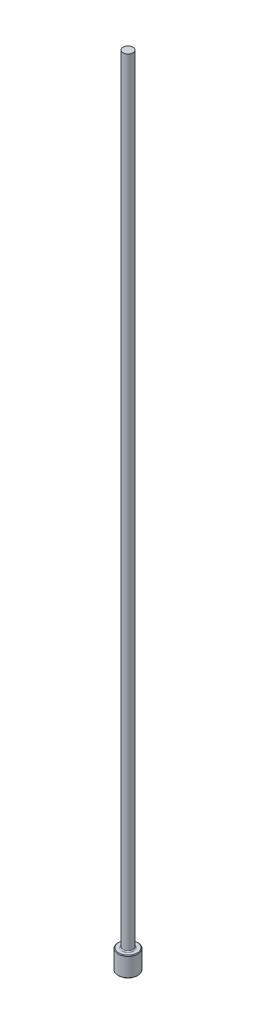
ISO-10303-21;
HEADER;
FILE_DESCRIPTION(('STEP AP214'),'2;1');
FILE_NAME('part.step','',(''),(''),'','','');
FILE_SCHEMA(('AUTOMOTIVE_DESIGN { 1 0 10303 214 1 1 1 1 }'));
ENDSEC;
DATA;
#1=APPLICATION_CONTEXT('core data for automotive mechanical design processes');
#2=APPLICATION_PROTOCOL_DEFINITION('international standard','automotive_design',2000,#1);
#3=PRODUCT_CONTEXT('',#1,'mechanical');
#4=PRODUCT('Part','Part','',(#3));
#5=PRODUCT_RELATED_PRODUCT_CATEGORY('part','',(#4));
#6=PRODUCT_DEFINITION_FORMATION('','',#4);
#7=PRODUCT_DEFINITION_CONTEXT('part definition',#1,'design');
#8=PRODUCT_DEFINITION('design','',#6,#7);
#9=PRODUCT_DEFINITION_SHAPE('','',#8);
#10=(LENGTH_UNIT() NAMED_UNIT(*) SI_UNIT(.MILLI.,.METRE.));
#11=(NAMED_UNIT(*) PLANE_ANGLE_UNIT() SI_UNIT($,.RADIAN.));
#12=(NAMED_UNIT(*) SI_UNIT($,.STERADIAN.) SOLID_ANGLE_UNIT());
#13=UNCERTAINTY_MEASURE_WITH_UNIT(LENGTH_MEASURE(1.E-05),#10,'distance_accuracy_value','');
#14=(GEOMETRIC_REPRESENTATION_CONTEXT(3) GLOBAL_UNCERTAINTY_ASSIGNED_CONTEXT((#13)) GLOBAL_UNIT_ASSIGNED_CONTEXT((#10,
#11,#12)) REPRESENTATION_CONTEXT('',''));
#15=CARTESIAN_POINT('',(0.,0.,0.));
#16=DIRECTION('',(0.,0.,1.));
#17=DIRECTION('',(1.,0.,0.));
#18=AXIS2_PLACEMENT_3D('',#15,#16,#17);
#19=CARTESIAN_POINT('',(0.,0.,0.));
#20=DIRECTION('',(0.,-1.,0.));
#21=DIRECTION('',(0.,0.,-1.));
#22=AXIS2_PLACEMENT_3D('',#19,#20,#21);
#23=PLANE('',#22);
#24=CARTESIAN_POINT('',(0.,0.,0.));
#25=DIRECTION('',(0.,-1.,0.));
#26=DIRECTION('',(0.,0.,-1.));
#27=AXIS2_PLACEMENT_3D('',#24,#25,#26);
#28=CIRCLE('',#27,0.736599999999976);
#29=CARTESIAN_POINT('',(0.,0.,0.736599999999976));
#30=VERTEX_POINT('',#29);
#31=EDGE_CURVE('E46',#30,#30,#28,.T.);
#32=ORIENTED_EDGE('',*,*,#31,.T.);
#33=EDGE_LOOP('',(#32));
#34=FACE_BOUND('',#33,.T.);
#35=ADVANCED_FACE('F35',(#34),#23,.T.);
#36=CARTESIAN_POINT('',(0.,259.958771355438,0.));
#37=DIRECTION('',(0.,1.,0.));
#38=DIRECTION('',(0.,0.,1.));
#39=AXIS2_PLACEMENT_3D('',#36,#37,#38);
#40=CYLINDRICAL_SURFACE('',#39,0.787399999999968);
#41=CARTESIAN_POINT('',(0.,1.52399999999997,0.));
#42=DIRECTION('',(0.,1.,0.));
#43=DIRECTION('',(0.,0.,1.));
#44=AXIS2_PLACEMENT_3D('',#41,#42,#43);
#45=CIRCLE('',#44,0.787399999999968);
#46=CARTESIAN_POINT('',(0.,1.52399999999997,0.787399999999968));
#47=VERTEX_POINT('',#46);
#48=EDGE_CURVE('E50',#47,#47,#45,.F.);
#49=ORIENTED_EDGE('',*,*,#48,.T.);
#50=EDGE_LOOP('',(#49));
#51=FACE_BOUND('',#50,.T.);
#52=CARTESIAN_POINT('',(0.,0.050799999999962,0.));
#53=DIRECTION('',(0.,-1.,0.));
#54=DIRECTION('',(0.,0.,-1.));
#55=AXIS2_PLACEMENT_3D('',#52,#53,#54);
#56=CIRCLE('',#55,0.787399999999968);
#57=CARTESIAN_POINT('',(0.,0.050799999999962,0.787399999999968));
#58=VERTEX_POINT('',#57);
#59=EDGE_CURVE('E55',#58,#58,#56,.F.);
#60=ORIENTED_EDGE('',*,*,#59,.T.);
#61=EDGE_LOOP('',(#60));
#62=FACE_BOUND('',#61,.T.);
#63=ADVANCED_FACE('F77',(#51,#62),#40,.T.);
#64=CARTESIAN_POINT('',(-0.787399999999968,1.5748,0.));
#65=DIRECTION('',(0.,1.,0.));
#66=DIRECTION('',(0.,0.,1.));
#67=AXIS2_PLACEMENT_3D('',#64,#65,#66);
#68=PLANE('',#67);
#69=CARTESIAN_POINT('',(0.,1.5748,0.));
#70=DIRECTION('',(0.,1.,0.));
#71=DIRECTION('',(0.,0.,1.));
#72=AXIS2_PLACEMENT_3D('',#69,#70,#71);
#73=CIRCLE('',#72,0.469899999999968);
#74=CARTESIAN_POINT('',(0.,1.5748,0.469899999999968));
#75=VERTEX_POINT('',#74);
#76=EDGE_CURVE('E10',#75,#75,#73,.F.);
#77=ORIENTED_EDGE('',*,*,#76,.T.);
#78=EDGE_LOOP('',(#77));
#79=FACE_BOUND('',#78,.T.);
#80=CARTESIAN_POINT('',(0.,1.5748,0.));
#81=DIRECTION('',(0.,1.,0.));
#82=DIRECTION('',(0.,0.,1.));
#83=AXIS2_PLACEMENT_3D('',#80,#81,#82);
#84=CIRCLE('',#83,0.73659999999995);
#85=CARTESIAN_POINT('',(0.,1.5748,0.73659999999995));
#86=VERTEX_POINT('',#85);
#87=EDGE_CURVE('E58',#86,#86,#84,.T.);
#88=ORIENTED_EDGE('',*,*,#87,.T.);
#89=EDGE_LOOP('',(#88));
#90=FACE_BOUND('',#89,.T.);
#91=ADVANCED_FACE('F69',(#79,#90),#68,.T.);
#92=CARTESIAN_POINT('',(0.,259.958771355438,0.));
#93=DIRECTION('',(0.,1.,0.));
#94=DIRECTION('',(0.,0.,1.));
#95=AXIS2_PLACEMENT_3D('',#92,#93,#94);
#96=CYLINDRICAL_SURFACE('',#95,0.393699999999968);
#97=CARTESIAN_POINT('',(0.,1.65100000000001,0.));
#98=DIRECTION('',(0.,1.,0.));
#99=DIRECTION('',(0.,0.,1.));
#100=AXIS2_PLACEMENT_3D('',#97,#98,#99);
#101=CIRCLE('',#100,0.393699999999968);
#102=CARTESIAN_POINT('',(0.,1.65100000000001,0.393699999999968));
#103=VERTEX_POINT('',#102);
#104=EDGE_CURVE('E42',#103,#103,#101,.T.);
#105=ORIENTED_EDGE('',*,*,#104,.T.);
#106=EDGE_LOOP('',(#105));
#107=FACE_BOUND('',#106,.T.);
#108=CARTESIAN_POINT('',(0.,63.5,0.));
#109=DIRECTION('',(0.,1.,0.));
#110=DIRECTION('',(0.,0.,1.));
#111=AXIS2_PLACEMENT_3D('',#108,#109,#110);
#112=CIRCLE('',#111,0.393699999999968);
#113=CARTESIAN_POINT('',(0.,63.5,0.393699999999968));
#114=VERTEX_POINT('',#113);
#115=EDGE_CURVE('E61',#114,#114,#112,.T.);
#116=ORIENTED_EDGE('',*,*,#115,.F.);
#117=EDGE_LOOP('',(#116));
#118=FACE_BOUND('',#117,.T.);
#119=ADVANCED_FACE('F67',(#107,#118),#96,.T.);
#120=CARTESIAN_POINT('',(-0.393699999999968,63.5,0.));
#121=DIRECTION('',(0.,1.,0.));
#122=DIRECTION('',(0.,0.,1.));
#123=AXIS2_PLACEMENT_3D('',#120,#121,#122);
#124=PLANE('',#123);
#125=ORIENTED_EDGE('',*,*,#115,.T.);
#126=EDGE_LOOP('',(#125));
#127=FACE_BOUND('',#126,.T.);
#128=ADVANCED_FACE('F65',(#127),#124,.T.);
#129=CARTESIAN_POINT('',(0.,1.57479999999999,0.));
#130=DIRECTION('',(0.,-1.,0.));
#131=DIRECTION('',(0.,0.,-1.));
#132=AXIS2_PLACEMENT_3D('',#129,#130,#131);
#133=CONICAL_SURFACE('',#132,0.736599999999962,0.785398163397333);
#134=ORIENTED_EDGE('',*,*,#48,.F.);
#135=EDGE_LOOP('',(#134));
#136=FACE_BOUND('',#135,.T.);
#137=ORIENTED_EDGE('',*,*,#87,.F.);
#138=EDGE_LOOP('',(#137));
#139=FACE_BOUND('',#138,.T.);
#140=ADVANCED_FACE('F75',(#136,#139),#133,.T.);
#141=CARTESIAN_POINT('',(0.,0.050799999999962,0.));
#142=DIRECTION('',(0.,1.,0.));
#143=DIRECTION('',(0.,0.,1.));
#144=AXIS2_PLACEMENT_3D('',#141,#142,#143);
#145=CONICAL_SURFACE('',#144,0.787399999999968,0.785398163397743);
#146=CARTESIAN_POINT('',(0.,0.,0.736599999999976));
#147=CARTESIAN_POINT('',(0.,0.000529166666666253,0.737129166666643));
#148=CARTESIAN_POINT('',(0.,0.00105833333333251,0.737658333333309));
#149=CARTESIAN_POINT('',(0.,0.00211666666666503,0.738716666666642));
#150=CARTESIAN_POINT('',(0.,0.00264583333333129,0.739245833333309));
#151=CARTESIAN_POINT('',(0.,0.00370416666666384,0.740304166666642));
#152=CARTESIAN_POINT('',(0.,0.00423333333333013,0.740833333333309));
#153=CARTESIAN_POINT('',(0.,0.00529166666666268,0.741891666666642));
#154=CARTESIAN_POINT('',(0.,0.00582083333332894,0.742420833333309));
#155=CARTESIAN_POINT('',(0.,0.00687916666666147,0.743479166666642));
#156=CARTESIAN_POINT('',(0.,0.00740833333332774,0.744008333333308));
#157=CARTESIAN_POINT('',(0.,0.00846666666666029,0.745066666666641));
#158=CARTESIAN_POINT('',(0.,0.00899583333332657,0.745595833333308));
#159=CARTESIAN_POINT('',(0.,0.0100541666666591,0.746654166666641));
#160=CARTESIAN_POINT('',(0.,0.0105833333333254,0.747183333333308));
#161=CARTESIAN_POINT('',(0.,0.0116416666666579,0.748241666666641));
#162=CARTESIAN_POINT('',(0.,0.0121708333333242,0.748770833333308));
#163=CARTESIAN_POINT('',(0.,0.0132291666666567,0.749829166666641));
#164=CARTESIAN_POINT('',(0.,0.013758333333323,0.750358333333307));
#165=CARTESIAN_POINT('',(0.,0.0148166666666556,0.75141666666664));
#166=CARTESIAN_POINT('',(0.,0.0153458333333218,0.751945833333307));
#167=CARTESIAN_POINT('',(0.,0.0164041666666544,0.75300416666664));
#168=CARTESIAN_POINT('',(0.,0.0169333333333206,0.753533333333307));
#169=CARTESIAN_POINT('',(0.,0.0179916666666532,0.75459166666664));
#170=CARTESIAN_POINT('',(0.,0.0185208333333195,0.755120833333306));
#171=CARTESIAN_POINT('',(0.,0.019579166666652,0.75617916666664));
#172=CARTESIAN_POINT('',(0.,0.0201083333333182,0.756708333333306));
#173=CARTESIAN_POINT('',(0.,0.0211666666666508,0.757766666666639));
#174=CARTESIAN_POINT('',(0.,0.0216958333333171,0.758295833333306));
#175=CARTESIAN_POINT('',(0.,0.0227541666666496,0.759354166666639));
#176=CARTESIAN_POINT('',(0.,0.0232833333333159,0.759883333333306));
#177=CARTESIAN_POINT('',(0.,0.0243416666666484,0.760941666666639));
#178=CARTESIAN_POINT('',(0.,0.0248708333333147,0.761470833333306));
#179=CARTESIAN_POINT('',(0.,0.0259291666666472,0.762529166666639));
#180=CARTESIAN_POINT('',(0.,0.0264583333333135,0.763058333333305));
#181=CARTESIAN_POINT('',(0.,0.0275166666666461,0.764116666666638));
#182=CARTESIAN_POINT('',(0.,0.0280458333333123,0.764645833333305));
#183=CARTESIAN_POINT('',(0.,0.0291041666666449,0.765704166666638));
#184=CARTESIAN_POINT('',(0.,0.0296333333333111,0.766233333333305));
#185=CARTESIAN_POINT('',(0.,0.0306916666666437,0.767291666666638));
#186=CARTESIAN_POINT('',(0.,0.03122083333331,0.767820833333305));
#187=CARTESIAN_POINT('',(0.,0.0322791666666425,0.768879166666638));
#188=CARTESIAN_POINT('',(0.,0.0328083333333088,0.769408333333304));
#189=CARTESIAN_POINT('',(0.,0.0338666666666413,0.770466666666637));
#190=CARTESIAN_POINT('',(0.,0.0343958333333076,0.770995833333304));
#191=CARTESIAN_POINT('',(0.,0.0354541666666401,0.772054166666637));
#192=CARTESIAN_POINT('',(0.,0.0359833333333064,0.772583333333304));
#193=CARTESIAN_POINT('',(0.,0.0370416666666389,0.773641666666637));
#194=CARTESIAN_POINT('',(0.,0.0375708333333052,0.774170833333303));
#195=CARTESIAN_POINT('',(0.,0.0386291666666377,0.775229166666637));
#196=CARTESIAN_POINT('',(0.,0.039158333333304,0.775758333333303));
#197=CARTESIAN_POINT('',(0.,0.0402166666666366,0.776816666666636));
#198=CARTESIAN_POINT('',(0.,0.0407458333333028,0.777345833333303));
#199=CARTESIAN_POINT('',(0.,0.0418041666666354,0.778404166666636));
#200=CARTESIAN_POINT('',(0.,0.0423333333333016,0.778933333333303));
#201=CARTESIAN_POINT('',(0.,0.0433916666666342,0.779991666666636));
#202=CARTESIAN_POINT('',(0.,0.0439208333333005,0.780520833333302));
#203=CARTESIAN_POINT('',(0.,0.044979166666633,0.781579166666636));
#204=CARTESIAN_POINT('',(0.,0.0455083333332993,0.782108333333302));
#205=CARTESIAN_POINT('',(0.,0.0465666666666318,0.783166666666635));
#206=CARTESIAN_POINT('',(0.,0.0470958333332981,0.783695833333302));
#207=CARTESIAN_POINT('',(0.,0.0481541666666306,0.784754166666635));
#208=CARTESIAN_POINT('',(0.,0.0486833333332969,0.785283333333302));
#209=CARTESIAN_POINT('',(0.,0.0497416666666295,0.786341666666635));
#210=CARTESIAN_POINT('',(0.,0.0502708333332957,0.786870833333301));
#211=CARTESIAN_POINT('',(0.,0.050799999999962,0.787399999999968));
#212=B_SPLINE_CURVE_WITH_KNOTS('',3,(#146,#147,#148,#149,#150,#151,#152,#153,#154,#155,#156,
#157,#158,#159,#160,#161,#162,#163,#164,#165,#166,#167,#168,#169,#170,#171,#172,#173,#174,#175,
#176,#177,#178,#179,#180,#181,#182,#183,#184,#185,#186,#187,#188,#189,#190,#191,#192,#193,#194,
#195,#196,#197,#198,#199,#200,#201,#202,#203,#204,#205,#206,#207,#208,#209,#210,#211),
.UNSPECIFIED.,.F.,.F.,(4,2,2,2,2,2,2,2,2,2,2,2,2,2,2,2,2,2,2,2,2,2,2,2,2,2,2,2,2,2,2,2,4),(0.,
0.00224506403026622,0.00449012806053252,0.00673519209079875,0.00898025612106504,
0.0112253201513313,0.0134703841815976,0.0157154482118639,0.0179605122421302,0.0202055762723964,
0.0224506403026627,0.024695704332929,0.0269407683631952,0.0291858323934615,0.0314308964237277,
0.033675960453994,0.0359210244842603,0.0381660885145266,0.0404111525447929,0.0426562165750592,
0.0449012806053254,0.0471463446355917,0.049391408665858,0.0516364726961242,0.0538815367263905,
0.0561266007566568,0.058371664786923,0.0606167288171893,0.0628617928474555,0.0651068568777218,
0.0673519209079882,0.0695969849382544,0.0718420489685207),.UNSPECIFIED.);
#213=EDGE_CURVE('BSEAM89',#30,#58,#212,.T.);
#214=ORIENTED_EDGE('',*,*,#31,.F.);
#215=ORIENTED_EDGE('',*,*,#59,.F.);
#216=ORIENTED_EDGE('',*,*,#213,.T.);
#217=ORIENTED_EDGE('',*,*,#213,.F.);
#218=EDGE_LOOP('',(#214,#216,#215,#217));
#219=FACE_BOUND('',#218,.T.);
#220=ADVANCED_FACE('F89',(#219),#145,.T.);
#221=CARTESIAN_POINT('',(0.,1.65100000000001,0.));
#222=DIRECTION('',(0.,1.,0.));
#223=DIRECTION('',(0.,0.,1.));
#224=AXIS2_PLACEMENT_3D('',#221,#222,#223);
#225=TOROIDAL_SURFACE('',#224,0.469899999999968,0.0762);
#226=ORIENTED_EDGE('',*,*,#76,.F.);
#227=EDGE_LOOP('',(#226));
#228=FACE_BOUND('',#227,.T.);
#229=ORIENTED_EDGE('',*,*,#104,.F.);
#230=EDGE_LOOP('',(#229));
#231=FACE_BOUND('',#230,.T.);
#232=ADVANCED_FACE('F37',(#228,#231),#225,.F.);
#233=CLOSED_SHELL('',(#35,#63,#91,#119,#128,#140,#220,#232));
#234=MANIFOLD_SOLID_BREP('B2',#233);
#235=ADVANCED_BREP_SHAPE_REPRESENTATION('',(#18,#234),#14);
#236=SHAPE_DEFINITION_REPRESENTATION(#9,#235);
ENDSEC;
END-ISO-10303-21;
